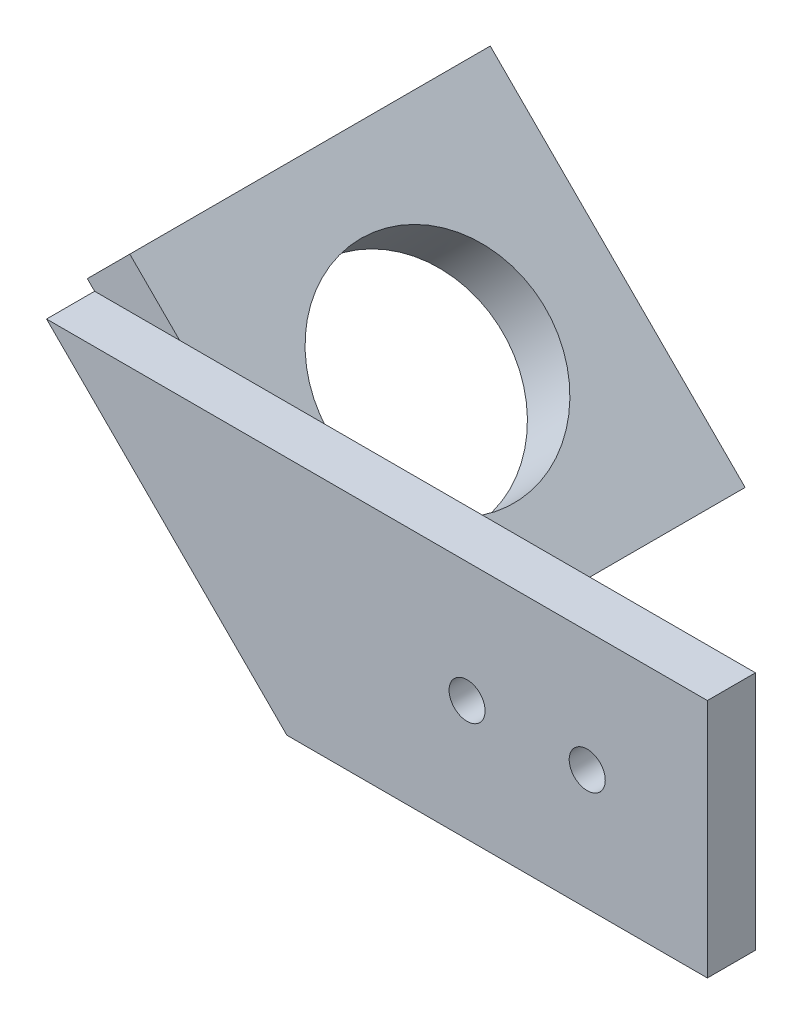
ISO-10303-21;
HEADER;
FILE_DESCRIPTION(('STEP AP214'),'2;1');
FILE_NAME('part.step','',(''),(''),'','','');
FILE_SCHEMA(('AUTOMOTIVE_DESIGN { 1 0 10303 214 1 1 1 1 }'));
ENDSEC;
DATA;
#1=APPLICATION_CONTEXT('core data for automotive mechanical design processes');
#2=APPLICATION_PROTOCOL_DEFINITION('international standard','automotive_design',2000,#1);
#3=PRODUCT_CONTEXT('',#1,'mechanical');
#4=PRODUCT('Part','Part','',(#3));
#5=PRODUCT_RELATED_PRODUCT_CATEGORY('part','',(#4));
#6=PRODUCT_DEFINITION_FORMATION('','',#4);
#7=PRODUCT_DEFINITION_CONTEXT('part definition',#1,'design');
#8=PRODUCT_DEFINITION('design','',#6,#7);
#9=PRODUCT_DEFINITION_SHAPE('','',#8);
#10=(LENGTH_UNIT() NAMED_UNIT(*) SI_UNIT(.MILLI.,.METRE.));
#11=(NAMED_UNIT(*) PLANE_ANGLE_UNIT() SI_UNIT($,.RADIAN.));
#12=(NAMED_UNIT(*) SI_UNIT($,.STERADIAN.) SOLID_ANGLE_UNIT());
#13=UNCERTAINTY_MEASURE_WITH_UNIT(LENGTH_MEASURE(1.E-05),#10,'distance_accuracy_value','');
#14=(GEOMETRIC_REPRESENTATION_CONTEXT(3) GLOBAL_UNCERTAINTY_ASSIGNED_CONTEXT((#13)) GLOBAL_UNIT_ASSIGNED_CONTEXT((#10,
#11,#12)) REPRESENTATION_CONTEXT('',''));
#15=CARTESIAN_POINT('',(0.,0.,0.));
#16=DIRECTION('',(0.,0.,1.));
#17=DIRECTION('',(1.,0.,0.));
#18=AXIS2_PLACEMENT_3D('',#15,#16,#17);
#19=CARTESIAN_POINT('',(40.,10.,4.));
#20=DIRECTION('',(-1.,0.,0.));
#21=DIRECTION('',(0.,-1.,0.));
#22=AXIS2_PLACEMENT_3D('',#19,#20,#21);
#23=PLANE('',#22);
#24=DIRECTION('',(0.,-1.,0.));
#25=VECTOR('',#24,1.);
#26=CARTESIAN_POINT('',(40.,52.,0.));
#27=LINE('',#26,#25);
#28=CARTESIAN_POINT('',(40.,10.,0.));
#29=VERTEX_POINT('',#28);
#30=CARTESIAN_POINT('',(40.,-10.,0.));
#31=VERTEX_POINT('',#30);
#32=EDGE_CURVE('E117',#29,#31,#27,.T.);
#33=ORIENTED_EDGE('',*,*,#32,.T.);
#34=DIRECTION('',(0.,0.,-1.));
#35=VECTOR('',#34,1.);
#36=CARTESIAN_POINT('',(40.,-10.,4.));
#37=LINE('',#36,#35);
#38=CARTESIAN_POINT('',(40.,-10.,-4.));
#39=VERTEX_POINT('',#38);
#40=EDGE_CURVE('E156',#31,#39,#37,.T.);
#41=ORIENTED_EDGE('',*,*,#40,.T.);
#42=DIRECTION('',(0.,1.,0.));
#43=VECTOR('',#42,1.);
#44=CARTESIAN_POINT('',(40.,10.,-4.));
#45=LINE('',#44,#43);
#46=CARTESIAN_POINT('',(40.,10.,-4.));
#47=VERTEX_POINT('',#46);
#48=EDGE_CURVE('E151',#39,#47,#45,.T.);
#49=ORIENTED_EDGE('',*,*,#48,.T.);
#50=DIRECTION('',(0.,0.,-1.));
#51=VECTOR('',#50,1.);
#52=CARTESIAN_POINT('',(40.,10.,4.));
#53=LINE('',#52,#51);
#54=EDGE_CURVE('E58',#29,#47,#53,.T.);
#55=ORIENTED_EDGE('',*,*,#54,.F.);
#56=EDGE_LOOP('',(#33,#41,#49,#55));
#57=FACE_BOUND('',#56,.T.);
#58=ADVANCED_FACE('F36',(#57),#23,.F.);
#59=CARTESIAN_POINT('',(-40.,10.,4.));
#60=DIRECTION('',(0.,-1.,0.));
#61=DIRECTION('',(0.,0.,-1.));
#62=AXIS2_PLACEMENT_3D('',#59,#60,#61);
#63=PLANE('',#62);
#64=DIRECTION('',(-1.,0.,0.));
#65=VECTOR('',#64,1.);
#66=CARTESIAN_POINT('',(-40.,10.,-4.));
#67=LINE('',#66,#65);
#68=CARTESIAN_POINT('',(-7.92893218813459,10.,-4.));
#69=VERTEX_POINT('',#68);
#70=CARTESIAN_POINT('',(-15.0000000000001,10.,-4.));
#71=VERTEX_POINT('',#70);
#72=EDGE_CURVE('E128',#69,#71,#67,.T.);
#73=ORIENTED_EDGE('',*,*,#72,.T.);
#74=DIRECTION('',(0.,0.,-1.));
#75=VECTOR('',#74,1.);
#76=CARTESIAN_POINT('',(-15.0000000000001,10.,38.));
#77=LINE('',#76,#75);
#78=CARTESIAN_POINT('',(-15.0000000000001,10.,0.));
#79=VERTEX_POINT('',#78);
#80=EDGE_CURVE('E118',#79,#71,#77,.T.);
#81=ORIENTED_EDGE('',*,*,#80,.F.);
#82=DIRECTION('',(-1.,0.,0.));
#83=VECTOR('',#82,1.);
#84=CARTESIAN_POINT('',(-40.,10.,0.));
#85=LINE('',#84,#83);
#86=EDGE_CURVE('E152',#29,#79,#85,.T.);
#87=ORIENTED_EDGE('',*,*,#86,.F.);
#88=ORIENTED_EDGE('',*,*,#54,.T.);
#89=EDGE_CURVE('E154',#47,#69,#67,.T.);
#90=ORIENTED_EDGE('',*,*,#89,.T.);
#91=EDGE_LOOP('',(#73,#81,#87,#88,#90));
#92=FACE_BOUND('',#91,.T.);
#93=ADVANCED_FACE('F202',(#92),#63,.F.);
#94=CARTESIAN_POINT('',(-40.,-10.,4.));
#95=DIRECTION('',(0.,1.,0.));
#96=DIRECTION('',(0.,0.,1.));
#97=AXIS2_PLACEMENT_3D('',#94,#95,#96);
#98=PLANE('',#97);
#99=DIRECTION('',(1.,0.,0.));
#100=VECTOR('',#99,1.);
#101=CARTESIAN_POINT('',(-40.,-10.,0.));
#102=LINE('',#101,#100);
#103=CARTESIAN_POINT('',(5.00000000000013,-10.,0.));
#104=VERTEX_POINT('',#103);
#105=EDGE_CURVE('E114',#104,#31,#102,.T.);
#106=ORIENTED_EDGE('',*,*,#105,.F.);
#107=DIRECTION('',(0.,0.,-1.));
#108=VECTOR('',#107,1.);
#109=CARTESIAN_POINT('',(5.00000000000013,-10.,38.));
#110=LINE('',#109,#108);
#111=CARTESIAN_POINT('',(5.00000000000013,-10.,-4.));
#112=VERTEX_POINT('',#111);
#113=EDGE_CURVE('E108',#104,#112,#110,.T.);
#114=ORIENTED_EDGE('',*,*,#113,.T.);
#115=DIRECTION('',(1.,0.,0.));
#116=VECTOR('',#115,1.);
#117=CARTESIAN_POINT('',(-40.,-10.,-4.));
#118=LINE('',#117,#116);
#119=CARTESIAN_POINT('',(6.21320343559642,-10.,-4.));
#120=VERTEX_POINT('',#119);
#121=EDGE_CURVE('E112',#112,#120,#118,.T.);
#122=ORIENTED_EDGE('',*,*,#121,.T.);
#123=EDGE_CURVE('E129',#120,#39,#118,.T.);
#124=ORIENTED_EDGE('',*,*,#123,.T.);
#125=ORIENTED_EDGE('',*,*,#40,.F.);
#126=EDGE_LOOP('',(#106,#114,#122,#124,#125));
#127=FACE_BOUND('',#126,.T.);
#128=ADVANCED_FACE('F110',(#127),#98,.F.);
#129=CARTESIAN_POINT('',(30.,0.,-16.));
#130=DIRECTION('',(0.,0.,1.));
#131=DIRECTION('',(1.,0.,0.));
#132=AXIS2_PLACEMENT_3D('',#129,#130,#131);
#133=CYLINDRICAL_SURFACE('',#132,1.5);
#134=CARTESIAN_POINT('',(30.,0.,-4.));
#135=DIRECTION('',(0.,0.,1.));
#136=DIRECTION('',(1.,0.,0.));
#137=AXIS2_PLACEMENT_3D('',#134,#135,#136);
#138=CIRCLE('',#137,1.5);
#139=CARTESIAN_POINT('',(31.5,0.,-4.));
#140=VERTEX_POINT('',#139);
#141=EDGE_CURVE('E170',#140,#140,#138,.T.);
#142=ORIENTED_EDGE('',*,*,#141,.F.);
#143=EDGE_LOOP('',(#142));
#144=FACE_BOUND('',#143,.T.);
#145=CARTESIAN_POINT('',(30.,0.,0.));
#146=DIRECTION('',(0.,0.,1.));
#147=DIRECTION('',(1.,0.,0.));
#148=AXIS2_PLACEMENT_3D('',#145,#146,#147);
#149=CIRCLE('',#148,1.5);
#150=CARTESIAN_POINT('',(31.5,0.,0.));
#151=VERTEX_POINT('',#150);
#152=EDGE_CURVE('E212',#151,#151,#149,.F.);
#153=ORIENTED_EDGE('',*,*,#152,.F.);
#154=EDGE_LOOP('',(#153));
#155=FACE_BOUND('',#154,.T.);
#156=ADVANCED_FACE('F225',(#144,#155),#133,.F.);
#157=CARTESIAN_POINT('',(20.,0.,-16.));
#158=DIRECTION('',(0.,0.,1.));
#159=DIRECTION('',(1.,0.,0.));
#160=AXIS2_PLACEMENT_3D('',#157,#158,#159);
#161=CYLINDRICAL_SURFACE('',#160,1.5);
#162=CARTESIAN_POINT('',(20.,0.,-4.));
#163=DIRECTION('',(0.,0.,1.));
#164=DIRECTION('',(1.,0.,0.));
#165=AXIS2_PLACEMENT_3D('',#162,#163,#164);
#166=CIRCLE('',#165,1.5);
#167=CARTESIAN_POINT('',(21.5,0.,-4.));
#168=VERTEX_POINT('',#167);
#169=EDGE_CURVE('E175',#168,#168,#166,.T.);
#170=ORIENTED_EDGE('',*,*,#169,.F.);
#171=EDGE_LOOP('',(#170));
#172=FACE_BOUND('',#171,.T.);
#173=CARTESIAN_POINT('',(20.,0.,0.));
#174=DIRECTION('',(0.,0.,1.));
#175=DIRECTION('',(1.,0.,0.));
#176=AXIS2_PLACEMENT_3D('',#173,#174,#175);
#177=CIRCLE('',#176,1.5);
#178=CARTESIAN_POINT('',(21.5,0.,0.));
#179=VERTEX_POINT('',#178);
#180=EDGE_CURVE('E209',#179,#179,#177,.F.);
#181=ORIENTED_EDGE('',*,*,#180,.F.);
#182=EDGE_LOOP('',(#181));
#183=FACE_BOUND('',#182,.T.);
#184=ADVANCED_FACE('F222',(#172,#183),#161,.F.);
#185=CARTESIAN_POINT('',(0.,0.,-4.));
#186=DIRECTION('',(0.,0.,-1.));
#187=DIRECTION('',(1.,0.,0.));
#188=AXIS2_PLACEMENT_3D('',#185,#186,#187);
#189=PLANE('',#188);
#190=ORIENTED_EDGE('',*,*,#169,.T.);
#191=EDGE_LOOP('',(#190));
#192=FACE_BOUND('',#191,.T.);
#193=ORIENTED_EDGE('',*,*,#141,.T.);
#194=EDGE_LOOP('',(#193));
#195=FACE_BOUND('',#194,.T.);
#196=ORIENTED_EDGE('',*,*,#123,.F.);
#197=DIRECTION('',(0.707106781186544,0.707106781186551,0.));
#198=VECTOR('',#197,1.);
#199=CARTESIAN_POINT('',(5.60660171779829,-10.6066017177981,-4.));
#200=LINE('',#199,#198);
#201=CARTESIAN_POINT('',(9.142135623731,-7.07106781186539,-4.));
#202=VERTEX_POINT('',#201);
#203=EDGE_CURVE('E43',#120,#202,#200,.T.);
#204=ORIENTED_EDGE('',*,*,#203,.T.);
#205=DIRECTION('',(-0.707106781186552,0.707106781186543,0.));
#206=VECTOR('',#205,1.);
#207=CARTESIAN_POINT('',(9.142135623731,-7.07106781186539,-4.));
#208=LINE('',#207,#206);
#209=EDGE_CURVE('E139',#202,#69,#208,.T.);
#210=ORIENTED_EDGE('',*,*,#209,.T.);
#211=ORIENTED_EDGE('',*,*,#89,.F.);
#212=ORIENTED_EDGE('',*,*,#48,.F.);
#213=EDGE_LOOP('',(#196,#204,#210,#211,#212));
#214=FACE_BOUND('',#213,.T.);
#215=ADVANCED_FACE('F204',(#192,#195,#214),#189,.T.);
#216=CARTESIAN_POINT('',(0.,0.,0.));
#217=DIRECTION('',(0.,0.,-1.));
#218=DIRECTION('',(1.,0.,0.));
#219=AXIS2_PLACEMENT_3D('',#216,#217,#218);
#220=PLANE('',#219);
#221=ORIENTED_EDGE('',*,*,#86,.T.);
#222=DIRECTION('',(0.707106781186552,-0.707106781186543,0.));
#223=VECTOR('',#222,1.);
#224=CARTESIAN_POINT('',(-2.49999999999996,-2.49999999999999,0.));
#225=LINE('',#224,#223);
#226=EDGE_CURVE('E11',#79,#104,#225,.T.);
#227=ORIENTED_EDGE('',*,*,#226,.T.);
#228=ORIENTED_EDGE('',*,*,#105,.T.);
#229=ORIENTED_EDGE('',*,*,#32,.F.);
#230=EDGE_LOOP('',(#221,#227,#228,#229));
#231=FACE_BOUND('',#230,.T.);
#232=ORIENTED_EDGE('',*,*,#152,.T.);
#233=EDGE_LOOP('',(#232));
#234=FACE_BOUND('',#233,.T.);
#235=ORIENTED_EDGE('',*,*,#180,.T.);
#236=EDGE_LOOP('',(#235));
#237=FACE_BOUND('',#236,.T.);
#238=ADVANCED_FACE('F229',(#231,#234,#237),#220,.F.);
#239=CARTESIAN_POINT('',(0.,0.,-4.));
#240=DIRECTION('',(0.,0.,-1.));
#241=DIRECTION('',(1.,0.,0.));
#242=AXIS2_PLACEMENT_3D('',#239,#240,#241);
#243=PLANE('',#242);
#244=ORIENTED_EDGE('',*,*,#121,.F.);
#245=DIRECTION('',(0.707106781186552,-0.707106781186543,0.));
#246=VECTOR('',#245,1.);
#247=CARTESIAN_POINT('',(-15.6066017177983,10.6066017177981,-4.));
#248=LINE('',#247,#246);
#249=CARTESIAN_POINT('',(5.60660171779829,-10.6066017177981,-4.));
#250=VERTEX_POINT('',#249);
#251=EDGE_CURVE('E123',#112,#250,#248,.T.);
#252=ORIENTED_EDGE('',*,*,#251,.T.);
#253=EDGE_CURVE('E126',#250,#120,#200,.T.);
#254=ORIENTED_EDGE('',*,*,#253,.T.);
#255=EDGE_LOOP('',(#244,#252,#254));
#256=FACE_BOUND('',#255,.T.);
#257=ADVANCED_FACE('F122',(#256),#243,.F.);
#258=CARTESIAN_POINT('',(-12.0710678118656,14.1421356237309,-34.));
#259=DIRECTION('',(-0.707106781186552,0.707106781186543,0.));
#260=DIRECTION('',(-0.707106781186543,-0.707106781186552,0.));
#261=AXIS2_PLACEMENT_3D('',#258,#259,#260);
#262=PLANE('',#261);
#263=DIRECTION('',(-0.707106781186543,-0.707106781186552,0.));
#264=VECTOR('',#263,1.);
#265=CARTESIAN_POINT('',(-12.0710678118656,14.1421356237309,-4.));
#266=LINE('',#265,#264);
#267=CARTESIAN_POINT('',(-12.0710678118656,14.1421356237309,-4.));
#268=VERTEX_POINT('',#267);
#269=CARTESIAN_POINT('',(-15.6066017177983,10.6066017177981,-4.));
#270=VERTEX_POINT('',#269);
#271=EDGE_CURVE('E163',#268,#270,#266,.T.);
#272=ORIENTED_EDGE('',*,*,#271,.F.);
#273=DIRECTION('',(0.,0.,1.));
#274=VECTOR('',#273,1.);
#275=CARTESIAN_POINT('',(-12.0710678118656,14.1421356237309,-34.));
#276=LINE('',#275,#274);
#277=CARTESIAN_POINT('',(-12.0710678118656,14.1421356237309,-34.));
#278=VERTEX_POINT('',#277);
#279=EDGE_CURVE('E149',#278,#268,#276,.T.);
#280=ORIENTED_EDGE('',*,*,#279,.F.);
#281=DIRECTION('',(-0.707106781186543,-0.707106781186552,0.));
#282=VECTOR('',#281,1.);
#283=CARTESIAN_POINT('',(-12.0710678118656,14.1421356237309,-34.));
#284=LINE('',#283,#282);
#285=CARTESIAN_POINT('',(-15.6066017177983,10.6066017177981,-34.));
#286=VERTEX_POINT('',#285);
#287=EDGE_CURVE('E138',#278,#286,#284,.T.);
#288=ORIENTED_EDGE('',*,*,#287,.T.);
#289=DIRECTION('',(0.,0.,1.));
#290=VECTOR('',#289,1.);
#291=CARTESIAN_POINT('',(-15.6066017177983,10.6066017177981,-34.));
#292=LINE('',#291,#290);
#293=EDGE_CURVE('E143',#286,#270,#292,.T.);
#294=ORIENTED_EDGE('',*,*,#293,.T.);
#295=EDGE_LOOP('',(#272,#280,#288,#294));
#296=FACE_BOUND('',#295,.T.);
#297=ADVANCED_FACE('F199',(#296),#262,.T.);
#298=CARTESIAN_POINT('',(9.142135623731,-7.07106781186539,-34.));
#299=DIRECTION('',(0.707106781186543,0.707106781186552,0.));
#300=DIRECTION('',(-0.707106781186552,0.707106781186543,0.));
#301=AXIS2_PLACEMENT_3D('',#298,#299,#300);
#302=PLANE('',#301);
#303=CARTESIAN_POINT('',(-1.46446609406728,3.53553390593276,-19.));
#304=DIRECTION('',(-0.707106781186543,-0.707106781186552,0.));
#305=DIRECTION('',(-0.707106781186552,0.707106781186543,0.));
#306=AXIS2_PLACEMENT_3D('',#303,#304,#305);
#307=CIRCLE('',#306,9.);
#308=CARTESIAN_POINT('',(-7.82842712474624,9.89949493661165,-19.));
#309=VERTEX_POINT('',#308);
#310=EDGE_CURVE('E164',#309,#309,#307,.T.);
#311=ORIENTED_EDGE('',*,*,#310,.T.);
#312=EDGE_LOOP('',(#311));
#313=FACE_BOUND('',#312,.T.);
#314=ORIENTED_EDGE('',*,*,#209,.F.);
#315=DIRECTION('',(0.,0.,1.));
#316=VECTOR('',#315,1.);
#317=CARTESIAN_POINT('',(9.142135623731,-7.07106781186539,-34.));
#318=LINE('',#317,#316);
#319=CARTESIAN_POINT('',(9.142135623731,-7.07106781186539,-34.));
#320=VERTEX_POINT('',#319);
#321=EDGE_CURVE('E147',#320,#202,#318,.T.);
#322=ORIENTED_EDGE('',*,*,#321,.F.);
#323=DIRECTION('',(-0.707106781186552,0.707106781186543,0.));
#324=VECTOR('',#323,1.);
#325=CARTESIAN_POINT('',(9.142135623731,-7.07106781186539,-34.));
#326=LINE('',#325,#324);
#327=EDGE_CURVE('E181',#320,#278,#326,.T.);
#328=ORIENTED_EDGE('',*,*,#327,.T.);
#329=ORIENTED_EDGE('',*,*,#279,.T.);
#330=EDGE_CURVE('E50',#69,#268,#208,.T.);
#331=ORIENTED_EDGE('',*,*,#330,.F.);
#332=EDGE_LOOP('',(#314,#322,#328,#329,#331));
#333=FACE_BOUND('',#332,.T.);
#334=ADVANCED_FACE('F195',(#313,#333),#302,.T.);
#335=CARTESIAN_POINT('',(5.60660171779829,-10.6066017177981,-34.));
#336=DIRECTION('',(0.707106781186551,-0.707106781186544,0.));
#337=DIRECTION('',(0.707106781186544,0.707106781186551,0.));
#338=AXIS2_PLACEMENT_3D('',#335,#336,#337);
#339=PLANE('',#338);
#340=ORIENTED_EDGE('',*,*,#253,.F.);
#341=DIRECTION('',(0.,0.,1.));
#342=VECTOR('',#341,1.);
#343=CARTESIAN_POINT('',(5.60660171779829,-10.6066017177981,-34.));
#344=LINE('',#343,#342);
#345=CARTESIAN_POINT('',(5.60660171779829,-10.6066017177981,-34.));
#346=VERTEX_POINT('',#345);
#347=EDGE_CURVE('E134',#346,#250,#344,.T.);
#348=ORIENTED_EDGE('',*,*,#347,.F.);
#349=DIRECTION('',(0.707106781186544,0.707106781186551,0.));
#350=VECTOR('',#349,1.);
#351=CARTESIAN_POINT('',(5.60660171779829,-10.6066017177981,-34.));
#352=LINE('',#351,#350);
#353=EDGE_CURVE('E184',#346,#320,#352,.T.);
#354=ORIENTED_EDGE('',*,*,#353,.T.);
#355=ORIENTED_EDGE('',*,*,#321,.T.);
#356=ORIENTED_EDGE('',*,*,#203,.F.);
#357=EDGE_LOOP('',(#340,#348,#354,#355,#356));
#358=FACE_BOUND('',#357,.T.);
#359=ADVANCED_FACE('F284',(#358),#339,.T.);
#360=CARTESIAN_POINT('',(-15.6066017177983,10.6066017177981,-34.));
#361=DIRECTION('',(-0.707106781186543,-0.707106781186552,0.));
#362=DIRECTION('',(0.707106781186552,-0.707106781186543,0.));
#363=AXIS2_PLACEMENT_3D('',#360,#361,#362);
#364=PLANE('',#363);
#365=CARTESIAN_POINT('',(-4.99999999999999,0.,-19.));
#366=DIRECTION('',(-0.707106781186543,-0.707106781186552,0.));
#367=DIRECTION('',(0.707106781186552,-0.707106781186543,0.));
#368=AXIS2_PLACEMENT_3D('',#365,#366,#367);
#369=CIRCLE('',#368,9.);
#370=CARTESIAN_POINT('',(1.36396103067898,-6.36396103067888,-19.));
#371=VERTEX_POINT('',#370);
#372=EDGE_CURVE('E161',#371,#371,#369,.F.);
#373=ORIENTED_EDGE('',*,*,#372,.T.);
#374=EDGE_LOOP('',(#373));
#375=FACE_BOUND('',#374,.T.);
#376=EDGE_CURVE('E135',#270,#71,#248,.T.);
#377=ORIENTED_EDGE('',*,*,#376,.F.);
#378=ORIENTED_EDGE('',*,*,#293,.F.);
#379=DIRECTION('',(0.707106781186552,-0.707106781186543,0.));
#380=VECTOR('',#379,1.);
#381=CARTESIAN_POINT('',(-15.6066017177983,10.6066017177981,-34.));
#382=LINE('',#381,#380);
#383=EDGE_CURVE('E145',#286,#346,#382,.T.);
#384=ORIENTED_EDGE('',*,*,#383,.T.);
#385=ORIENTED_EDGE('',*,*,#347,.T.);
#386=ORIENTED_EDGE('',*,*,#251,.F.);
#387=ORIENTED_EDGE('',*,*,#113,.F.);
#388=ORIENTED_EDGE('',*,*,#226,.F.);
#389=ORIENTED_EDGE('',*,*,#80,.T.);
#390=EDGE_LOOP('',(#377,#378,#384,#385,#386,#387,#388,#389));
#391=FACE_BOUND('',#390,.T.);
#392=ADVANCED_FACE('F132',(#375,#391),#364,.T.);
#393=CARTESIAN_POINT('',(0.,0.,-34.));
#394=DIRECTION('',(0.,0.,-1.));
#395=DIRECTION('',(1.,0.,0.));
#396=AXIS2_PLACEMENT_3D('',#393,#394,#395);
#397=PLANE('',#396);
#398=ORIENTED_EDGE('',*,*,#287,.F.);
#399=ORIENTED_EDGE('',*,*,#327,.F.);
#400=ORIENTED_EDGE('',*,*,#353,.F.);
#401=ORIENTED_EDGE('',*,*,#383,.F.);
#402=EDGE_LOOP('',(#398,#399,#400,#401));
#403=FACE_BOUND('',#402,.T.);
#404=ADVANCED_FACE('F300',(#403),#397,.T.);
#405=ORIENTED_EDGE('',*,*,#72,.F.);
#406=ORIENTED_EDGE('',*,*,#330,.T.);
#407=ORIENTED_EDGE('',*,*,#271,.T.);
#408=ORIENTED_EDGE('',*,*,#376,.T.);
#409=EDGE_LOOP('',(#405,#406,#407,#408));
#410=FACE_BOUND('',#409,.T.);
#411=ADVANCED_FACE('F192',(#410),#243,.F.);
#412=CARTESIAN_POINT('',(-15.6066017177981,-10.6066017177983,-19.));
#413=DIRECTION('',(0.707106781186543,0.707106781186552,0.));
#414=DIRECTION('',(-0.707106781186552,0.707106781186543,0.));
#415=AXIS2_PLACEMENT_3D('',#412,#413,#414);
#416=CYLINDRICAL_SURFACE('',#415,9.);
#417=ORIENTED_EDGE('',*,*,#372,.F.);
#418=EDGE_LOOP('',(#417));
#419=FACE_BOUND('',#418,.T.);
#420=ORIENTED_EDGE('',*,*,#310,.F.);
#421=EDGE_LOOP('',(#420));
#422=FACE_BOUND('',#421,.T.);
#423=ADVANCED_FACE('F312',(#419,#422),#416,.F.);
#424=CLOSED_SHELL('',(#58,#93,#128,#156,#184,#215,#238,#257,#297,#334,#359,#392,#404,#411,#423));
#425=MANIFOLD_SOLID_BREP('B2',#424);
#426=ADVANCED_BREP_SHAPE_REPRESENTATION('',(#18,#425),#14);
#427=SHAPE_DEFINITION_REPRESENTATION(#9,#426);
ENDSEC;
END-ISO-10303-21;
